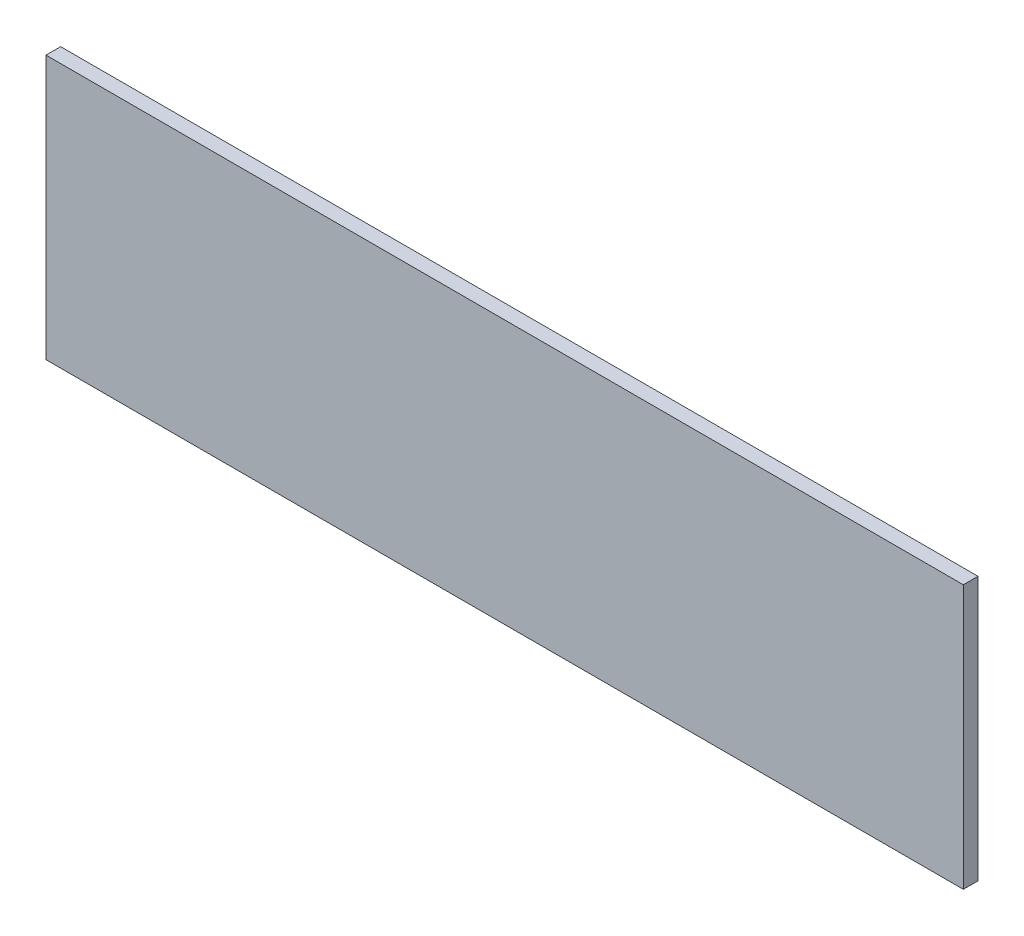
ISO-10303-21;
HEADER;
FILE_DESCRIPTION(('STEP AP214'),'2;1');
FILE_NAME('part.step','',(''),(''),'','','');
FILE_SCHEMA(('AUTOMOTIVE_DESIGN { 1 0 10303 214 1 1 1 1 }'));
ENDSEC;
DATA;
#1=APPLICATION_CONTEXT('core data for automotive mechanical design processes');
#2=APPLICATION_PROTOCOL_DEFINITION('international standard','automotive_design',2000,#1);
#3=PRODUCT_CONTEXT('',#1,'mechanical');
#4=PRODUCT('Part','Part','',(#3));
#5=PRODUCT_RELATED_PRODUCT_CATEGORY('part','',(#4));
#6=PRODUCT_DEFINITION_FORMATION('','',#4);
#7=PRODUCT_DEFINITION_CONTEXT('part definition',#1,'design');
#8=PRODUCT_DEFINITION('design','',#6,#7);
#9=PRODUCT_DEFINITION_SHAPE('','',#8);
#10=(LENGTH_UNIT() NAMED_UNIT(*) SI_UNIT(.MILLI.,.METRE.));
#11=(NAMED_UNIT(*) PLANE_ANGLE_UNIT() SI_UNIT($,.RADIAN.));
#12=(NAMED_UNIT(*) SI_UNIT($,.STERADIAN.) SOLID_ANGLE_UNIT());
#13=UNCERTAINTY_MEASURE_WITH_UNIT(LENGTH_MEASURE(1.E-05),#10,'distance_accuracy_value','');
#14=(GEOMETRIC_REPRESENTATION_CONTEXT(3) GLOBAL_UNCERTAINTY_ASSIGNED_CONTEXT((#13)) GLOBAL_UNIT_ASSIGNED_CONTEXT((#10,
#11,#12)) REPRESENTATION_CONTEXT('',''));
#15=CARTESIAN_POINT('',(0.,0.,0.));
#16=DIRECTION('',(0.,0.,1.));
#17=DIRECTION('',(1.,0.,0.));
#18=AXIS2_PLACEMENT_3D('',#15,#16,#17);
#19=CARTESIAN_POINT('',(0.,0.,-100.));
#20=DIRECTION('',(1.,0.,0.));
#21=DIRECTION('',(0.,0.,-1.));
#22=AXIS2_PLACEMENT_3D('',#19,#20,#21);
#23=PLANE('',#22);
#24=DIRECTION('',(0.,1.,0.));
#25=VECTOR('',#24,1.);
#26=CARTESIAN_POINT('',(0.,0.,0.));
#27=LINE('',#26,#25);
#28=CARTESIAN_POINT('',(0.,0.,0.));
#29=VERTEX_POINT('',#28);
#30=CARTESIAN_POINT('',(0.,1800.,0.));
#31=VERTEX_POINT('',#30);
#32=EDGE_CURVE('E99',#29,#31,#27,.T.);
#33=ORIENTED_EDGE('',*,*,#32,.F.);
#34=DIRECTION('',(0.,0.,1.));
#35=VECTOR('',#34,1.);
#36=CARTESIAN_POINT('',(0.,0.,-100.));
#37=LINE('',#36,#35);
#38=CARTESIAN_POINT('',(0.,0.,-100.));
#39=VERTEX_POINT('',#38);
#40=EDGE_CURVE('E11',#39,#29,#37,.T.);
#41=ORIENTED_EDGE('',*,*,#40,.F.);
#42=DIRECTION('',(0.,1.,0.));
#43=VECTOR('',#42,1.);
#44=CARTESIAN_POINT('',(0.,0.,-100.));
#45=LINE('',#44,#43);
#46=CARTESIAN_POINT('',(0.,1800.,-100.));
#47=VERTEX_POINT('',#46);
#48=EDGE_CURVE('E93',#39,#47,#45,.T.);
#49=ORIENTED_EDGE('',*,*,#48,.T.);
#50=DIRECTION('',(0.,0.,1.));
#51=VECTOR('',#50,1.);
#52=CARTESIAN_POINT('',(0.,1800.,-100.));
#53=LINE('',#52,#51);
#54=EDGE_CURVE('E38',#47,#31,#53,.T.);
#55=ORIENTED_EDGE('',*,*,#54,.T.);
#56=EDGE_LOOP('',(#33,#41,#49,#55));
#57=FACE_BOUND('',#56,.T.);
#58=ADVANCED_FACE('F35',(#57),#23,.T.);
#59=CARTESIAN_POINT('',(0.,0.,-100.));
#60=DIRECTION('',(0.,-1.,0.));
#61=DIRECTION('',(1.,0.,0.));
#62=AXIS2_PLACEMENT_3D('',#59,#60,#61);
#63=PLANE('',#62);
#64=DIRECTION('',(1.,0.,0.));
#65=VECTOR('',#64,1.);
#66=CARTESIAN_POINT('',(0.,0.,0.));
#67=LINE('',#66,#65);
#68=CARTESIAN_POINT('',(-6260.,-7.66628896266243E-13,0.));
#69=VERTEX_POINT('',#68);
#70=EDGE_CURVE('E95',#69,#29,#67,.T.);
#71=ORIENTED_EDGE('',*,*,#70,.F.);
#72=DIRECTION('',(0.,0.,1.));
#73=VECTOR('',#72,1.);
#74=CARTESIAN_POINT('',(-6260.,-7.66628896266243E-13,-100.));
#75=LINE('',#74,#73);
#76=CARTESIAN_POINT('',(-6260.,-7.66628896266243E-13,-100.));
#77=VERTEX_POINT('',#76);
#78=EDGE_CURVE('E44',#77,#69,#75,.T.);
#79=ORIENTED_EDGE('',*,*,#78,.F.);
#80=DIRECTION('',(1.,0.,0.));
#81=VECTOR('',#80,1.);
#82=CARTESIAN_POINT('',(0.,0.,-100.));
#83=LINE('',#82,#81);
#84=EDGE_CURVE('E90',#77,#39,#83,.T.);
#85=ORIENTED_EDGE('',*,*,#84,.T.);
#86=ORIENTED_EDGE('',*,*,#40,.T.);
#87=EDGE_LOOP('',(#71,#79,#85,#86));
#88=FACE_BOUND('',#87,.T.);
#89=ADVANCED_FACE('F109',(#88),#63,.T.);
#90=CARTESIAN_POINT('',(-6260.,-7.66628896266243E-13,-100.));
#91=DIRECTION('',(-1.,0.,0.));
#92=DIRECTION('',(0.,0.,1.));
#93=AXIS2_PLACEMENT_3D('',#90,#91,#92);
#94=PLANE('',#93);
#95=DIRECTION('',(0.,-1.,0.));
#96=VECTOR('',#95,1.);
#97=CARTESIAN_POINT('',(-6260.,-7.66628896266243E-13,0.));
#98=LINE('',#97,#96);
#99=CARTESIAN_POINT('',(-6260.,1800.,0.));
#100=VERTEX_POINT('',#99);
#101=EDGE_CURVE('E85',#100,#69,#98,.T.);
#102=ORIENTED_EDGE('',*,*,#101,.F.);
#103=DIRECTION('',(0.,0.,1.));
#104=VECTOR('',#103,1.);
#105=CARTESIAN_POINT('',(-6260.,1800.,-100.));
#106=LINE('',#105,#104);
#107=CARTESIAN_POINT('',(-6260.,1800.,-100.));
#108=VERTEX_POINT('',#107);
#109=EDGE_CURVE('E80',#108,#100,#106,.T.);
#110=ORIENTED_EDGE('',*,*,#109,.F.);
#111=DIRECTION('',(0.,-1.,0.));
#112=VECTOR('',#111,1.);
#113=CARTESIAN_POINT('',(-6260.,-7.66628896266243E-13,-100.));
#114=LINE('',#113,#112);
#115=EDGE_CURVE('E83',#108,#77,#114,.T.);
#116=ORIENTED_EDGE('',*,*,#115,.T.);
#117=ORIENTED_EDGE('',*,*,#78,.T.);
#118=EDGE_LOOP('',(#102,#110,#116,#117));
#119=FACE_BOUND('',#118,.T.);
#120=ADVANCED_FACE('F82',(#119),#94,.T.);
#121=CARTESIAN_POINT('',(0.,1800.,-100.));
#122=DIRECTION('',(0.,1.,0.));
#123=DIRECTION('',(-1.,0.,0.));
#124=AXIS2_PLACEMENT_3D('',#121,#122,#123);
#125=PLANE('',#124);
#126=DIRECTION('',(-1.,0.,0.));
#127=VECTOR('',#126,1.);
#128=CARTESIAN_POINT('',(0.,1800.,0.));
#129=LINE('',#128,#127);
#130=EDGE_CURVE('E102',#31,#100,#129,.T.);
#131=ORIENTED_EDGE('',*,*,#130,.F.);
#132=ORIENTED_EDGE('',*,*,#54,.F.);
#133=DIRECTION('',(-1.,0.,0.));
#134=VECTOR('',#133,1.);
#135=CARTESIAN_POINT('',(0.,1800.,-100.));
#136=LINE('',#135,#134);
#137=EDGE_CURVE('E89',#47,#108,#136,.T.);
#138=ORIENTED_EDGE('',*,*,#137,.T.);
#139=ORIENTED_EDGE('',*,*,#109,.T.);
#140=EDGE_LOOP('',(#131,#132,#138,#139));
#141=FACE_BOUND('',#140,.T.);
#142=ADVANCED_FACE('F92',(#141),#125,.T.);
#143=CARTESIAN_POINT('',(0.,0.,-100.));
#144=DIRECTION('',(0.,0.,1.));
#145=DIRECTION('',(1.,0.,0.));
#146=AXIS2_PLACEMENT_3D('',#143,#144,#145);
#147=PLANE('',#146);
#148=ORIENTED_EDGE('',*,*,#48,.F.);
#149=ORIENTED_EDGE('',*,*,#84,.F.);
#150=ORIENTED_EDGE('',*,*,#115,.F.);
#151=ORIENTED_EDGE('',*,*,#137,.F.);
#152=EDGE_LOOP('',(#148,#149,#150,#151));
#153=FACE_BOUND('',#152,.T.);
#154=ADVANCED_FACE('F88',(#153),#147,.F.);
#155=CARTESIAN_POINT('',(0.,0.,0.));
#156=DIRECTION('',(0.,0.,1.));
#157=DIRECTION('',(1.,0.,0.));
#158=AXIS2_PLACEMENT_3D('',#155,#156,#157);
#159=PLANE('',#158);
#160=ORIENTED_EDGE('',*,*,#32,.T.);
#161=ORIENTED_EDGE('',*,*,#130,.T.);
#162=ORIENTED_EDGE('',*,*,#101,.T.);
#163=ORIENTED_EDGE('',*,*,#70,.T.);
#164=EDGE_LOOP('',(#160,#161,#162,#163));
#165=FACE_BOUND('',#164,.T.);
#166=ADVANCED_FACE('F108',(#165),#159,.T.);
#167=CLOSED_SHELL('',(#58,#89,#120,#142,#154,#166));
#168=MANIFOLD_SOLID_BREP('B2',#167);
#169=ADVANCED_BREP_SHAPE_REPRESENTATION('',(#18,#168),#14);
#170=SHAPE_DEFINITION_REPRESENTATION(#9,#169);
ENDSEC;
END-ISO-10303-21;
